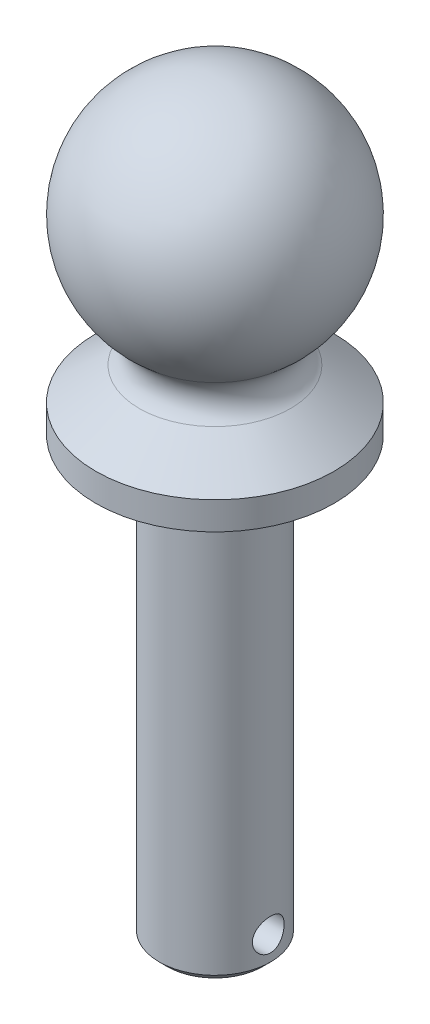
from build123d import *

# Parameters (mm, degrees)
ENL_V_MAT_EXTRU_1_DEPTH      = 82.798532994
ENL_V_MAT_EXTRU_1_DEPTH_BACK = 82.798532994
ESQUISSE2_R                  = 2


with BuildPart() as part:
    # Esquisse1 → Base-R_volution (revolve)
    with BuildSketch(Plane.XY, mode=Mode.PRIVATE) as base_r_volution_sk:
        with BuildLine():
            Line((0, 15), (0, -79))
            Line((0, -79), (-6, -79))
            Line((-6, -79), (-7, -78))
            Line((-7, -78), (-7, -24))
            Line((-7, -24), (-15, -24))
            Line((-15, -24), (-15, -20.5))
            Line((-15, -20.5), (-9.523650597, -16.391354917))
            ThreePointArc((-9.523650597, -16.391354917), (-8.324544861, -14.046766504), (-9.436698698, -11.659704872))
            ThreePointArc((-9.436698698, -11.659704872), (-14.140289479, 5.005218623), (0, 15))
        make_face()
    revolve(base_r_volution_sk.sketch.rotate(Axis((0, -80, 0), (0, -1, 0)), 270), axis=Axis((0, -80, 0), (0, -1, 0)))

    # Esquisse2 → Enl_v. mat.-Extru.1 (cut, two sides: drawn at the far end of the back side and taken through both)
    with BuildSketch(Plane(origin=(0, 0, 0), x_dir=(0, 0, -1), z_dir=(1, 0, 0)).offset(-ENL_V_MAT_EXTRU_1_DEPTH_BACK)):
        with Locations((0, -75)):
            Circle(ESQUISSE2_R)
    extrude(amount=ENL_V_MAT_EXTRU_1_DEPTH + ENL_V_MAT_EXTRU_1_DEPTH_BACK, mode=Mode.SUBTRACT)


solid = part.part
